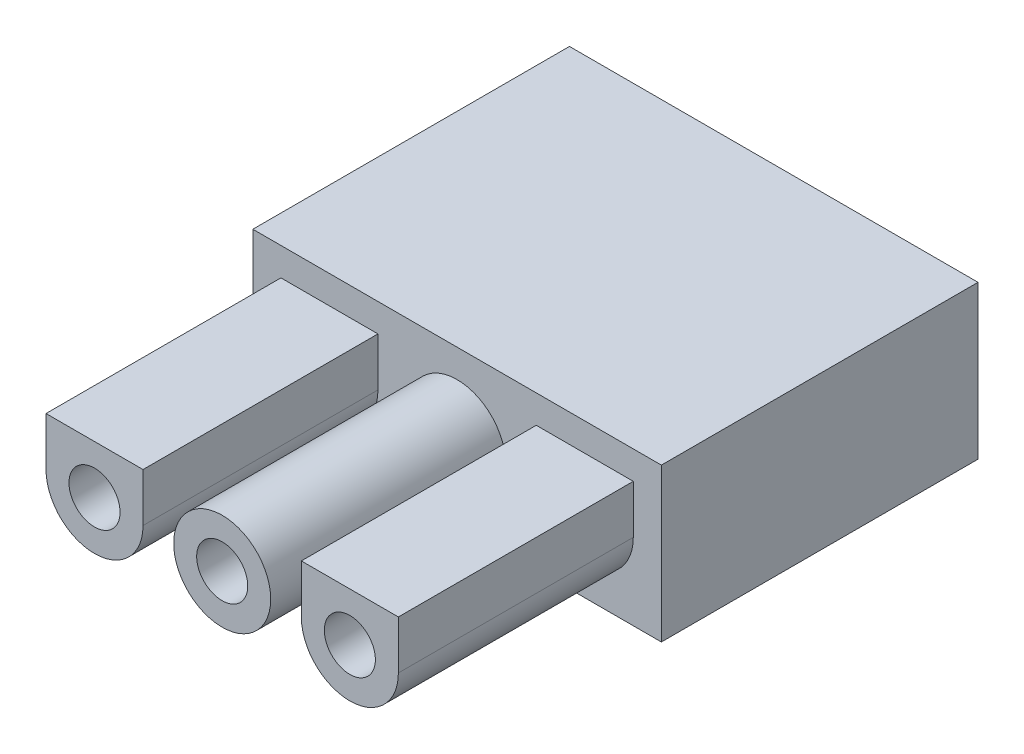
ISO-10303-21;
HEADER;
FILE_DESCRIPTION(('STEP AP214'),'2;1');
FILE_NAME('part.step','',(''),(''),'','','');
FILE_SCHEMA(('AUTOMOTIVE_DESIGN { 1 0 10303 214 1 1 1 1 }'));
ENDSEC;
DATA;
#1=APPLICATION_CONTEXT('core data for automotive mechanical design processes');
#2=APPLICATION_PROTOCOL_DEFINITION('international standard','automotive_design',2000,#1);
#3=PRODUCT_CONTEXT('',#1,'mechanical');
#4=PRODUCT('Part','Part','',(#3));
#5=PRODUCT_RELATED_PRODUCT_CATEGORY('part','',(#4));
#6=PRODUCT_DEFINITION_FORMATION('','',#4);
#7=PRODUCT_DEFINITION_CONTEXT('part definition',#1,'design');
#8=PRODUCT_DEFINITION('design','',#6,#7);
#9=PRODUCT_DEFINITION_SHAPE('','',#8);
#10=(LENGTH_UNIT() NAMED_UNIT(*) SI_UNIT(.MILLI.,.METRE.));
#11=(NAMED_UNIT(*) PLANE_ANGLE_UNIT() SI_UNIT($,.RADIAN.));
#12=(NAMED_UNIT(*) SI_UNIT($,.STERADIAN.) SOLID_ANGLE_UNIT());
#13=UNCERTAINTY_MEASURE_WITH_UNIT(LENGTH_MEASURE(1.E-05),#10,'distance_accuracy_value','');
#14=(GEOMETRIC_REPRESENTATION_CONTEXT(3) GLOBAL_UNCERTAINTY_ASSIGNED_CONTEXT((#13)) GLOBAL_UNIT_ASSIGNED_CONTEXT((#10,
#11,#12)) REPRESENTATION_CONTEXT('',''));
#15=CARTESIAN_POINT('',(0.,0.,0.));
#16=DIRECTION('',(0.,0.,1.));
#17=DIRECTION('',(1.,0.,0.));
#18=AXIS2_PLACEMENT_3D('',#15,#16,#17);
#19=CARTESIAN_POINT('',(0.,-7.62,15.748));
#20=DIRECTION('',(0.,0.,1.));
#21=DIRECTION('',(1.,0.,0.));
#22=AXIS2_PLACEMENT_3D('',#19,#20,#21);
#23=PLANE('',#22);
#24=DIRECTION('',(0.,1.,0.));
#25=VECTOR('',#24,1.);
#26=CARTESIAN_POINT('',(18.923,-3.81,15.748));
#27=LINE('',#26,#25);
#28=CARTESIAN_POINT('',(18.923,-3.81,15.748));
#29=VERTEX_POINT('',#28);
#30=CARTESIAN_POINT('',(18.923,-1.39700000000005,15.748));
#31=VERTEX_POINT('',#30);
#32=EDGE_CURVE('E128',#29,#31,#27,.T.);
#33=ORIENTED_EDGE('',*,*,#32,.F.);
#34=CARTESIAN_POINT('',(16.51,-3.81,15.748));
#35=DIRECTION('',(0.,0.,1.));
#36=DIRECTION('',(1.,0.,0.));
#37=AXIS2_PLACEMENT_3D('',#34,#35,#36);
#38=CIRCLE('',#37,2.413);
#39=CARTESIAN_POINT('',(14.097,-3.81,15.748));
#40=VERTEX_POINT('',#39);
#41=EDGE_CURVE('E139',#40,#29,#38,.T.);
#42=ORIENTED_EDGE('',*,*,#41,.F.);
#43=DIRECTION('',(0.,-1.,0.));
#44=VECTOR('',#43,1.);
#45=CARTESIAN_POINT('',(14.097,-3.81,15.748));
#46=LINE('',#45,#44);
#47=CARTESIAN_POINT('',(14.0970000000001,-1.39700000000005,15.748));
#48=VERTEX_POINT('',#47);
#49=EDGE_CURVE('E151',#48,#40,#46,.T.);
#50=ORIENTED_EDGE('',*,*,#49,.F.);
#51=DIRECTION('',(-1.,0.,0.));
#52=VECTOR('',#51,1.);
#53=CARTESIAN_POINT('',(16.51,-1.397,15.748));
#54=LINE('',#53,#52);
#55=EDGE_CURVE('E149',#31,#48,#54,.T.);
#56=ORIENTED_EDGE('',*,*,#55,.F.);
#57=EDGE_LOOP('',(#33,#42,#50,#56));
#58=FACE_BOUND('',#57,.T.);
#59=DIRECTION('',(0.,-1.,0.));
#60=VECTOR('',#59,1.);
#61=CARTESIAN_POINT('',(0.,0.,15.748));
#62=LINE('',#61,#60);
#63=CARTESIAN_POINT('',(0.,0.,15.748));
#64=VERTEX_POINT('',#63);
#65=CARTESIAN_POINT('',(0.,-7.62,15.748));
#66=VERTEX_POINT('',#65);
#67=EDGE_CURVE('E201',#64,#66,#62,.T.);
#68=ORIENTED_EDGE('',*,*,#67,.T.);
#69=DIRECTION('',(1.,0.,0.));
#70=VECTOR('',#69,1.);
#71=CARTESIAN_POINT('',(0.,-7.62,15.748));
#72=LINE('',#71,#70);
#73=CARTESIAN_POINT('',(20.32,-7.62,15.748));
#74=VERTEX_POINT('',#73);
#75=EDGE_CURVE('E204',#66,#74,#72,.T.);
#76=ORIENTED_EDGE('',*,*,#75,.T.);
#77=DIRECTION('',(0.,1.,0.));
#78=VECTOR('',#77,1.);
#79=CARTESIAN_POINT('',(20.32,0.,15.748));
#80=LINE('',#79,#78);
#81=CARTESIAN_POINT('',(20.32,0.,15.748));
#82=VERTEX_POINT('',#81);
#83=EDGE_CURVE('E206',#74,#82,#80,.T.);
#84=ORIENTED_EDGE('',*,*,#83,.T.);
#85=DIRECTION('',(-1.,0.,0.));
#86=VECTOR('',#85,1.);
#87=CARTESIAN_POINT('',(0.,0.,15.748));
#88=LINE('',#87,#86);
#89=EDGE_CURVE('E208',#82,#64,#88,.T.);
#90=ORIENTED_EDGE('',*,*,#89,.T.);
#91=EDGE_LOOP('',(#68,#76,#84,#90));
#92=FACE_BOUND('',#91,.T.);
#93=DIRECTION('',(0.,1.,0.));
#94=VECTOR('',#93,1.);
#95=CARTESIAN_POINT('',(6.22300000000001,-3.81000000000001,15.748));
#96=LINE('',#95,#94);
#97=CARTESIAN_POINT('',(6.22300000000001,-3.81000000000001,15.748));
#98=VERTEX_POINT('',#97);
#99=CARTESIAN_POINT('',(6.22299999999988,-1.39700000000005,15.748));
#100=VERTEX_POINT('',#99);
#101=EDGE_CURVE('E168',#98,#100,#96,.T.);
#102=ORIENTED_EDGE('',*,*,#101,.F.);
#103=CARTESIAN_POINT('',(3.81,-3.81000000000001,15.748));
#104=DIRECTION('',(0.,0.,1.));
#105=DIRECTION('',(-1.,0.,0.));
#106=AXIS2_PLACEMENT_3D('',#103,#104,#105);
#107=CIRCLE('',#106,2.413);
#108=CARTESIAN_POINT('',(1.397,-3.81000000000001,15.748));
#109=VERTEX_POINT('',#108);
#110=EDGE_CURVE('E134',#109,#98,#107,.T.);
#111=ORIENTED_EDGE('',*,*,#110,.F.);
#112=DIRECTION('',(0.,-1.,0.));
#113=VECTOR('',#112,1.);
#114=CARTESIAN_POINT('',(1.397,-3.81000000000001,15.748));
#115=LINE('',#114,#113);
#116=CARTESIAN_POINT('',(1.39699999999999,-1.39700000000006,15.748));
#117=VERTEX_POINT('',#116);
#118=EDGE_CURVE('E172',#117,#109,#115,.T.);
#119=ORIENTED_EDGE('',*,*,#118,.F.);
#120=DIRECTION('',(-1.,0.,0.));
#121=VECTOR('',#120,1.);
#122=CARTESIAN_POINT('',(3.81,-1.39700000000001,15.748));
#123=LINE('',#122,#121);
#124=EDGE_CURVE('E170',#100,#117,#123,.T.);
#125=ORIENTED_EDGE('',*,*,#124,.F.);
#126=EDGE_LOOP('',(#102,#111,#119,#125));
#127=FACE_BOUND('',#126,.T.);
#128=CARTESIAN_POINT('',(10.16,-3.81,15.748));
#129=DIRECTION('',(0.,0.,1.));
#130=DIRECTION('',(1.,0.,0.));
#131=AXIS2_PLACEMENT_3D('',#128,#129,#130);
#132=CIRCLE('',#131,2.413);
#133=CARTESIAN_POINT('',(12.573,-3.81,15.748));
#134=VERTEX_POINT('',#133);
#135=EDGE_CURVE('E276',#134,#134,#132,.T.);
#136=ORIENTED_EDGE('',*,*,#135,.F.);
#137=EDGE_LOOP('',(#136));
#138=FACE_BOUND('',#137,.T.);
#139=ADVANCED_FACE('F33',(#58,#92,#127,#138),#23,.T.);
#140=CARTESIAN_POINT('',(0.,0.,15.748));
#141=DIRECTION('',(1.,0.,0.));
#142=DIRECTION('',(0.,1.,0.));
#143=AXIS2_PLACEMENT_3D('',#140,#141,#142);
#144=PLANE('',#143);
#145=DIRECTION('',(0.,-1.,0.));
#146=VECTOR('',#145,1.);
#147=CARTESIAN_POINT('',(0.,0.,0.));
#148=LINE('',#147,#146);
#149=CARTESIAN_POINT('',(0.,0.,0.));
#150=VERTEX_POINT('',#149);
#151=CARTESIAN_POINT('',(0.,-7.62,0.));
#152=VERTEX_POINT('',#151);
#153=EDGE_CURVE('E192',#150,#152,#148,.T.);
#154=ORIENTED_EDGE('',*,*,#153,.T.);
#155=DIRECTION('',(0.,0.,-1.));
#156=VECTOR('',#155,1.);
#157=CARTESIAN_POINT('',(0.,-7.62,15.748));
#158=LINE('',#157,#156);
#159=EDGE_CURVE('E11',#66,#152,#158,.T.);
#160=ORIENTED_EDGE('',*,*,#159,.F.);
#161=ORIENTED_EDGE('',*,*,#67,.F.);
#162=DIRECTION('',(0.,0.,-1.));
#163=VECTOR('',#162,1.);
#164=CARTESIAN_POINT('',(0.,0.,15.748));
#165=LINE('',#164,#163);
#166=EDGE_CURVE('E210',#64,#150,#165,.T.);
#167=ORIENTED_EDGE('',*,*,#166,.T.);
#168=EDGE_LOOP('',(#154,#160,#161,#167));
#169=FACE_BOUND('',#168,.T.);
#170=ADVANCED_FACE('F35',(#169),#144,.F.);
#171=CARTESIAN_POINT('',(0.,-7.62,15.748));
#172=DIRECTION('',(0.,1.,0.));
#173=DIRECTION('',(0.,0.,1.));
#174=AXIS2_PLACEMENT_3D('',#171,#172,#173);
#175=PLANE('',#174);
#176=DIRECTION('',(1.,0.,0.));
#177=VECTOR('',#176,1.);
#178=CARTESIAN_POINT('',(0.,-7.62,0.));
#179=LINE('',#178,#177);
#180=CARTESIAN_POINT('',(20.32,-7.62,0.));
#181=VERTEX_POINT('',#180);
#182=EDGE_CURVE('E195',#152,#181,#179,.T.);
#183=ORIENTED_EDGE('',*,*,#182,.T.);
#184=DIRECTION('',(0.,0.,-1.));
#185=VECTOR('',#184,1.);
#186=CARTESIAN_POINT('',(20.32,-7.62,15.748));
#187=LINE('',#186,#185);
#188=EDGE_CURVE('E41',#74,#181,#187,.T.);
#189=ORIENTED_EDGE('',*,*,#188,.F.);
#190=ORIENTED_EDGE('',*,*,#75,.F.);
#191=ORIENTED_EDGE('',*,*,#159,.T.);
#192=EDGE_LOOP('',(#183,#189,#190,#191));
#193=FACE_BOUND('',#192,.T.);
#194=ADVANCED_FACE('F235',(#193),#175,.F.);
#195=CARTESIAN_POINT('',(20.32,0.,15.748));
#196=DIRECTION('',(-1.,0.,0.));
#197=DIRECTION('',(0.,-1.,0.));
#198=AXIS2_PLACEMENT_3D('',#195,#196,#197);
#199=PLANE('',#198);
#200=DIRECTION('',(0.,1.,0.));
#201=VECTOR('',#200,1.);
#202=CARTESIAN_POINT('',(20.32,0.,0.));
#203=LINE('',#202,#201);
#204=CARTESIAN_POINT('',(20.32,0.,0.));
#205=VERTEX_POINT('',#204);
#206=EDGE_CURVE('E197',#181,#205,#203,.T.);
#207=ORIENTED_EDGE('',*,*,#206,.T.);
#208=DIRECTION('',(0.,0.,-1.));
#209=VECTOR('',#208,1.);
#210=CARTESIAN_POINT('',(20.32,0.,15.748));
#211=LINE('',#210,#209);
#212=EDGE_CURVE('E213',#82,#205,#211,.T.);
#213=ORIENTED_EDGE('',*,*,#212,.F.);
#214=ORIENTED_EDGE('',*,*,#83,.F.);
#215=ORIENTED_EDGE('',*,*,#188,.T.);
#216=EDGE_LOOP('',(#207,#213,#214,#215));
#217=FACE_BOUND('',#216,.T.);
#218=ADVANCED_FACE('F220',(#217),#199,.F.);
#219=CARTESIAN_POINT('',(0.,0.,15.748));
#220=DIRECTION('',(0.,-1.,0.));
#221=DIRECTION('',(0.,0.,-1.));
#222=AXIS2_PLACEMENT_3D('',#219,#220,#221);
#223=PLANE('',#222);
#224=DIRECTION('',(-1.,0.,0.));
#225=VECTOR('',#224,1.);
#226=CARTESIAN_POINT('',(0.,0.,0.));
#227=LINE('',#226,#225);
#228=EDGE_CURVE('E199',#205,#150,#227,.T.);
#229=ORIENTED_EDGE('',*,*,#228,.T.);
#230=ORIENTED_EDGE('',*,*,#166,.F.);
#231=ORIENTED_EDGE('',*,*,#89,.F.);
#232=ORIENTED_EDGE('',*,*,#212,.T.);
#233=EDGE_LOOP('',(#229,#230,#231,#232));
#234=FACE_BOUND('',#233,.T.);
#235=ADVANCED_FACE('F229',(#234),#223,.F.);
#236=CARTESIAN_POINT('',(0.,-7.62,0.));
#237=DIRECTION('',(0.,0.,1.));
#238=DIRECTION('',(1.,0.,0.));
#239=AXIS2_PLACEMENT_3D('',#236,#237,#238);
#240=PLANE('',#239);
#241=CARTESIAN_POINT('',(10.16,-3.81,0.));
#242=DIRECTION('',(0.,0.,-1.));
#243=DIRECTION('',(-1.,0.,0.));
#244=AXIS2_PLACEMENT_3D('',#241,#242,#243);
#245=CIRCLE('',#244,1.27);
#246=CARTESIAN_POINT('',(8.89000000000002,-3.81,0.));
#247=VERTEX_POINT('',#246);
#248=EDGE_CURVE('E263',#247,#247,#245,.T.);
#249=ORIENTED_EDGE('',*,*,#248,.F.);
#250=EDGE_LOOP('',(#249));
#251=FACE_BOUND('',#250,.T.);
#252=CARTESIAN_POINT('',(16.51,-3.81,0.));
#253=DIRECTION('',(0.,0.,-1.));
#254=DIRECTION('',(-1.,0.,0.));
#255=AXIS2_PLACEMENT_3D('',#252,#253,#254);
#256=CIRCLE('',#255,1.27);
#257=CARTESIAN_POINT('',(15.24,-3.81,0.));
#258=VERTEX_POINT('',#257);
#259=EDGE_CURVE('E267',#258,#258,#256,.T.);
#260=ORIENTED_EDGE('',*,*,#259,.F.);
#261=EDGE_LOOP('',(#260));
#262=FACE_BOUND('',#261,.T.);
#263=CARTESIAN_POINT('',(3.81,-3.81000000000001,0.));
#264=DIRECTION('',(0.,0.,-1.));
#265=DIRECTION('',(-1.,0.,0.));
#266=AXIS2_PLACEMENT_3D('',#263,#264,#265);
#267=CIRCLE('',#266,1.27);
#268=CARTESIAN_POINT('',(2.54,-3.81000000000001,0.));
#269=VERTEX_POINT('',#268);
#270=EDGE_CURVE('E270',#269,#269,#267,.T.);
#271=ORIENTED_EDGE('',*,*,#270,.F.);
#272=EDGE_LOOP('',(#271));
#273=FACE_BOUND('',#272,.T.);
#274=ORIENTED_EDGE('',*,*,#153,.F.);
#275=ORIENTED_EDGE('',*,*,#228,.F.);
#276=ORIENTED_EDGE('',*,*,#206,.F.);
#277=ORIENTED_EDGE('',*,*,#182,.F.);
#278=EDGE_LOOP('',(#274,#275,#276,#277));
#279=FACE_BOUND('',#278,.T.);
#280=ADVANCED_FACE('F226',(#251,#262,#273,#279),#240,.F.);
#281=CARTESIAN_POINT('',(3.81,-3.81000000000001,27.432));
#282=DIRECTION('',(0.,0.,-1.));
#283=DIRECTION('',(-1.,0.,0.));
#284=AXIS2_PLACEMENT_3D('',#281,#282,#283);
#285=CYLINDRICAL_SURFACE('',#284,2.413);
#286=ORIENTED_EDGE('',*,*,#110,.T.);
#287=DIRECTION('',(0.,0.,-1.));
#288=VECTOR('',#287,1.);
#289=CARTESIAN_POINT('',(6.22300000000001,-3.81000000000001,27.432));
#290=LINE('',#289,#288);
#291=CARTESIAN_POINT('',(6.22300000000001,-3.81000000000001,27.432));
#292=VERTEX_POINT('',#291);
#293=EDGE_CURVE('E190',#292,#98,#290,.T.);
#294=ORIENTED_EDGE('',*,*,#293,.F.);
#295=CARTESIAN_POINT('',(3.81,-3.81000000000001,27.432));
#296=DIRECTION('',(0.,0.,1.));
#297=DIRECTION('',(-1.,0.,0.));
#298=AXIS2_PLACEMENT_3D('',#295,#296,#297);
#299=CIRCLE('',#298,2.413);
#300=CARTESIAN_POINT('',(1.397,-3.81000000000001,27.432));
#301=VERTEX_POINT('',#300);
#302=EDGE_CURVE('E174',#301,#292,#299,.T.);
#303=ORIENTED_EDGE('',*,*,#302,.F.);
#304=DIRECTION('',(0.,0.,-1.));
#305=VECTOR('',#304,1.);
#306=CARTESIAN_POINT('',(1.397,-3.81000000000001,27.432));
#307=LINE('',#306,#305);
#308=EDGE_CURVE('E183',#301,#109,#307,.T.);
#309=ORIENTED_EDGE('',*,*,#308,.T.);
#310=EDGE_LOOP('',(#286,#294,#303,#309));
#311=FACE_BOUND('',#310,.T.);
#312=ADVANCED_FACE('F253',(#311),#285,.T.);
#313=CARTESIAN_POINT('',(6.22300000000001,-3.81000000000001,27.432));
#314=DIRECTION('',(-1.,0.,0.));
#315=DIRECTION('',(0.,-1.,0.));
#316=AXIS2_PLACEMENT_3D('',#313,#314,#315);
#317=PLANE('',#316);
#318=ORIENTED_EDGE('',*,*,#101,.T.);
#319=DIRECTION('',(0.,0.,-1.));
#320=VECTOR('',#319,1.);
#321=CARTESIAN_POINT('',(6.22299999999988,-1.39700000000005,27.432));
#322=LINE('',#321,#320);
#323=CARTESIAN_POINT('',(6.22299999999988,-1.39700000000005,27.432));
#324=VERTEX_POINT('',#323);
#325=EDGE_CURVE('E187',#324,#100,#322,.T.);
#326=ORIENTED_EDGE('',*,*,#325,.F.);
#327=DIRECTION('',(0.,1.,0.));
#328=VECTOR('',#327,1.);
#329=CARTESIAN_POINT('',(6.22300000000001,-3.81000000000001,27.432));
#330=LINE('',#329,#328);
#331=EDGE_CURVE('E177',#292,#324,#330,.T.);
#332=ORIENTED_EDGE('',*,*,#331,.F.);
#333=ORIENTED_EDGE('',*,*,#293,.T.);
#334=EDGE_LOOP('',(#318,#326,#332,#333));
#335=FACE_BOUND('',#334,.T.);
#336=ADVANCED_FACE('F258',(#335),#317,.F.);
#337=CARTESIAN_POINT('',(3.81,-1.39700000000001,27.432));
#338=DIRECTION('',(0.,-1.,0.));
#339=DIRECTION('',(1.,0.,0.));
#340=AXIS2_PLACEMENT_3D('',#337,#338,#339);
#341=PLANE('',#340);
#342=ORIENTED_EDGE('',*,*,#124,.T.);
#343=DIRECTION('',(0.,0.,-1.));
#344=VECTOR('',#343,1.);
#345=CARTESIAN_POINT('',(1.39699999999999,-1.39700000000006,27.432));
#346=LINE('',#345,#344);
#347=CARTESIAN_POINT('',(1.39699999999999,-1.39700000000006,27.432));
#348=VERTEX_POINT('',#347);
#349=EDGE_CURVE('E56',#348,#117,#346,.T.);
#350=ORIENTED_EDGE('',*,*,#349,.F.);
#351=DIRECTION('',(-1.,0.,0.));
#352=VECTOR('',#351,1.);
#353=CARTESIAN_POINT('',(3.81,-1.39700000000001,27.432));
#354=LINE('',#353,#352);
#355=EDGE_CURVE('E179',#324,#348,#354,.T.);
#356=ORIENTED_EDGE('',*,*,#355,.F.);
#357=ORIENTED_EDGE('',*,*,#325,.T.);
#358=EDGE_LOOP('',(#342,#350,#356,#357));
#359=FACE_BOUND('',#358,.T.);
#360=ADVANCED_FACE('F324',(#359),#341,.F.);
#361=CARTESIAN_POINT('',(1.397,-3.81000000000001,27.432));
#362=DIRECTION('',(1.,0.,0.));
#363=DIRECTION('',(0.,1.,0.));
#364=AXIS2_PLACEMENT_3D('',#361,#362,#363);
#365=PLANE('',#364);
#366=ORIENTED_EDGE('',*,*,#118,.T.);
#367=ORIENTED_EDGE('',*,*,#308,.F.);
#368=DIRECTION('',(0.,-1.,0.));
#369=VECTOR('',#368,1.);
#370=CARTESIAN_POINT('',(1.397,-3.81000000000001,27.432));
#371=LINE('',#370,#369);
#372=EDGE_CURVE('E181',#348,#301,#371,.T.);
#373=ORIENTED_EDGE('',*,*,#372,.F.);
#374=ORIENTED_EDGE('',*,*,#349,.T.);
#375=EDGE_LOOP('',(#366,#367,#373,#374));
#376=FACE_BOUND('',#375,.T.);
#377=ADVANCED_FACE('F320',(#376),#365,.F.);
#378=CARTESIAN_POINT('',(3.81,-3.81000000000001,27.432));
#379=DIRECTION('',(0.,0.,-1.));
#380=DIRECTION('',(-1.,0.,0.));
#381=AXIS2_PLACEMENT_3D('',#378,#379,#380);
#382=PLANE('',#381);
#383=CARTESIAN_POINT('',(3.81,-3.81000000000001,27.432));
#384=DIRECTION('',(0.,0.,-1.));
#385=DIRECTION('',(-1.,0.,0.));
#386=AXIS2_PLACEMENT_3D('',#383,#384,#385);
#387=CIRCLE('',#386,1.27);
#388=CARTESIAN_POINT('',(2.54,-3.81000000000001,27.432));
#389=VERTEX_POINT('',#388);
#390=EDGE_CURVE('E272',#389,#389,#387,.T.);
#391=ORIENTED_EDGE('',*,*,#390,.T.);
#392=EDGE_LOOP('',(#391));
#393=FACE_BOUND('',#392,.T.);
#394=ORIENTED_EDGE('',*,*,#302,.T.);
#395=ORIENTED_EDGE('',*,*,#331,.T.);
#396=ORIENTED_EDGE('',*,*,#355,.T.);
#397=ORIENTED_EDGE('',*,*,#372,.T.);
#398=EDGE_LOOP('',(#394,#395,#396,#397));
#399=FACE_BOUND('',#398,.T.);
#400=ADVANCED_FACE('F317',(#393,#399),#382,.F.);
#401=CARTESIAN_POINT('',(16.51,-3.81,27.432));
#402=DIRECTION('',(0.,0.,-1.));
#403=DIRECTION('',(-1.,0.,0.));
#404=AXIS2_PLACEMENT_3D('',#401,#402,#403);
#405=CYLINDRICAL_SURFACE('',#404,2.413);
#406=ORIENTED_EDGE('',*,*,#41,.T.);
#407=DIRECTION('',(0.,0.,-1.));
#408=VECTOR('',#407,1.);
#409=CARTESIAN_POINT('',(18.923,-3.81,27.432));
#410=LINE('',#409,#408);
#411=CARTESIAN_POINT('',(18.923,-3.81,27.432));
#412=VERTEX_POINT('',#411);
#413=EDGE_CURVE('E123',#412,#29,#410,.T.);
#414=ORIENTED_EDGE('',*,*,#413,.F.);
#415=CARTESIAN_POINT('',(16.51,-3.81,27.432));
#416=DIRECTION('',(0.,0.,1.));
#417=DIRECTION('',(1.,0.,0.));
#418=AXIS2_PLACEMENT_3D('',#415,#416,#417);
#419=CIRCLE('',#418,2.413);
#420=CARTESIAN_POINT('',(14.097,-3.81,27.432));
#421=VERTEX_POINT('',#420);
#422=EDGE_CURVE('E156',#421,#412,#419,.T.);
#423=ORIENTED_EDGE('',*,*,#422,.F.);
#424=DIRECTION('',(0.,0.,-1.));
#425=VECTOR('',#424,1.);
#426=CARTESIAN_POINT('',(14.097,-3.81,27.432));
#427=LINE('',#426,#425);
#428=EDGE_CURVE('E142',#421,#40,#427,.T.);
#429=ORIENTED_EDGE('',*,*,#428,.T.);
#430=EDGE_LOOP('',(#406,#414,#423,#429));
#431=FACE_BOUND('',#430,.T.);
#432=ADVANCED_FACE('F140',(#431),#405,.T.);
#433=CARTESIAN_POINT('',(18.923,-3.81,27.432));
#434=DIRECTION('',(-1.,0.,0.));
#435=DIRECTION('',(0.,-1.,0.));
#436=AXIS2_PLACEMENT_3D('',#433,#434,#435);
#437=PLANE('',#436);
#438=ORIENTED_EDGE('',*,*,#32,.T.);
#439=DIRECTION('',(0.,0.,-1.));
#440=VECTOR('',#439,1.);
#441=CARTESIAN_POINT('',(18.923,-1.39700000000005,27.432));
#442=LINE('',#441,#440);
#443=CARTESIAN_POINT('',(18.923,-1.39700000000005,27.432));
#444=VERTEX_POINT('',#443);
#445=EDGE_CURVE('E135',#444,#31,#442,.T.);
#446=ORIENTED_EDGE('',*,*,#445,.F.);
#447=DIRECTION('',(0.,1.,0.));
#448=VECTOR('',#447,1.);
#449=CARTESIAN_POINT('',(18.923,-3.81,27.432));
#450=LINE('',#449,#448);
#451=EDGE_CURVE('E130',#412,#444,#450,.T.);
#452=ORIENTED_EDGE('',*,*,#451,.F.);
#453=ORIENTED_EDGE('',*,*,#413,.T.);
#454=EDGE_LOOP('',(#438,#446,#452,#453));
#455=FACE_BOUND('',#454,.T.);
#456=ADVANCED_FACE('F125',(#455),#437,.F.);
#457=CARTESIAN_POINT('',(16.51,-1.397,27.432));
#458=DIRECTION('',(0.,-1.,0.));
#459=DIRECTION('',(1.,0.,0.));
#460=AXIS2_PLACEMENT_3D('',#457,#458,#459);
#461=PLANE('',#460);
#462=ORIENTED_EDGE('',*,*,#55,.T.);
#463=DIRECTION('',(0.,0.,-1.));
#464=VECTOR('',#463,1.);
#465=CARTESIAN_POINT('',(14.0970000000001,-1.39700000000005,27.432));
#466=LINE('',#465,#464);
#467=CARTESIAN_POINT('',(14.0970000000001,-1.39700000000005,27.432));
#468=VERTEX_POINT('',#467);
#469=EDGE_CURVE('E48',#468,#48,#466,.T.);
#470=ORIENTED_EDGE('',*,*,#469,.F.);
#471=DIRECTION('',(-1.,0.,0.));
#472=VECTOR('',#471,1.);
#473=CARTESIAN_POINT('',(16.51,-1.397,27.432));
#474=LINE('',#473,#472);
#475=EDGE_CURVE('E159',#444,#468,#474,.T.);
#476=ORIENTED_EDGE('',*,*,#475,.F.);
#477=ORIENTED_EDGE('',*,*,#445,.T.);
#478=EDGE_LOOP('',(#462,#470,#476,#477));
#479=FACE_BOUND('',#478,.T.);
#480=ADVANCED_FACE('F309',(#479),#461,.F.);
#481=CARTESIAN_POINT('',(14.097,-3.81,27.432));
#482=DIRECTION('',(1.,0.,0.));
#483=DIRECTION('',(0.,1.,0.));
#484=AXIS2_PLACEMENT_3D('',#481,#482,#483);
#485=PLANE('',#484);
#486=ORIENTED_EDGE('',*,*,#49,.T.);
#487=ORIENTED_EDGE('',*,*,#428,.F.);
#488=DIRECTION('',(0.,-1.,0.));
#489=VECTOR('',#488,1.);
#490=CARTESIAN_POINT('',(14.097,-3.81,27.432));
#491=LINE('',#490,#489);
#492=EDGE_CURVE('E161',#468,#421,#491,.T.);
#493=ORIENTED_EDGE('',*,*,#492,.F.);
#494=ORIENTED_EDGE('',*,*,#469,.T.);
#495=EDGE_LOOP('',(#486,#487,#493,#494));
#496=FACE_BOUND('',#495,.T.);
#497=ADVANCED_FACE('F302',(#496),#485,.F.);
#498=CARTESIAN_POINT('',(16.51,-3.81,27.432));
#499=DIRECTION('',(0.,0.,1.));
#500=DIRECTION('',(1.,0.,0.));
#501=AXIS2_PLACEMENT_3D('',#498,#499,#500);
#502=PLANE('',#501);
#503=CARTESIAN_POINT('',(16.51,-3.81,27.432));
#504=DIRECTION('',(0.,0.,-1.));
#505=DIRECTION('',(-1.,0.,0.));
#506=AXIS2_PLACEMENT_3D('',#503,#504,#505);
#507=CIRCLE('',#506,1.27);
#508=CARTESIAN_POINT('',(15.24,-3.81,27.432));
#509=VERTEX_POINT('',#508);
#510=EDGE_CURVE('E273',#509,#509,#507,.T.);
#511=ORIENTED_EDGE('',*,*,#510,.T.);
#512=EDGE_LOOP('',(#511));
#513=FACE_BOUND('',#512,.T.);
#514=ORIENTED_EDGE('',*,*,#422,.T.);
#515=ORIENTED_EDGE('',*,*,#451,.T.);
#516=ORIENTED_EDGE('',*,*,#475,.T.);
#517=ORIENTED_EDGE('',*,*,#492,.T.);
#518=EDGE_LOOP('',(#514,#515,#516,#517));
#519=FACE_BOUND('',#518,.T.);
#520=ADVANCED_FACE('F291',(#513,#519),#502,.T.);
#521=CARTESIAN_POINT('',(10.16,-3.81,27.432));
#522=DIRECTION('',(0.,0.,-1.));
#523=DIRECTION('',(-1.,0.,0.));
#524=AXIS2_PLACEMENT_3D('',#521,#522,#523);
#525=CYLINDRICAL_SURFACE('',#524,2.413);
#526=CARTESIAN_POINT('',(10.16,-3.81,27.432));
#527=DIRECTION('',(0.,0.,1.));
#528=DIRECTION('',(1.,0.,0.));
#529=AXIS2_PLACEMENT_3D('',#526,#527,#528);
#530=CIRCLE('',#529,2.413);
#531=CARTESIAN_POINT('',(12.573,-3.81,27.432));
#532=VERTEX_POINT('',#531);
#533=EDGE_CURVE('E145',#532,#532,#530,.T.);
#534=ORIENTED_EDGE('',*,*,#533,.F.);
#535=EDGE_LOOP('',(#534));
#536=FACE_BOUND('',#535,.T.);
#537=ORIENTED_EDGE('',*,*,#135,.T.);
#538=EDGE_LOOP('',(#537));
#539=FACE_BOUND('',#538,.T.);
#540=ADVANCED_FACE('F288',(#536,#539),#525,.T.);
#541=CARTESIAN_POINT('',(10.16,-3.81,27.432));
#542=DIRECTION('',(0.,0.,1.));
#543=DIRECTION('',(1.,0.,0.));
#544=AXIS2_PLACEMENT_3D('',#541,#542,#543);
#545=PLANE('',#544);
#546=CARTESIAN_POINT('',(10.16,-3.81,27.432));
#547=DIRECTION('',(0.,0.,-1.));
#548=DIRECTION('',(-1.,0.,0.));
#549=AXIS2_PLACEMENT_3D('',#546,#547,#548);
#550=CIRCLE('',#549,1.27);
#551=CARTESIAN_POINT('',(8.89000000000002,-3.81,27.432));
#552=VERTEX_POINT('',#551);
#553=EDGE_CURVE('E421',#552,#552,#550,.T.);
#554=ORIENTED_EDGE('',*,*,#553,.T.);
#555=EDGE_LOOP('',(#554));
#556=FACE_BOUND('',#555,.T.);
#557=ORIENTED_EDGE('',*,*,#533,.T.);
#558=EDGE_LOOP('',(#557));
#559=FACE_BOUND('',#558,.T.);
#560=ADVANCED_FACE('F286',(#556,#559),#545,.T.);
#561=CARTESIAN_POINT('',(3.81,-3.81000000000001,27.432));
#562=DIRECTION('',(0.,0.,-1.));
#563=DIRECTION('',(-1.,0.,0.));
#564=AXIS2_PLACEMENT_3D('',#561,#562,#563);
#565=CYLINDRICAL_SURFACE('',#564,1.27);
#566=ORIENTED_EDGE('',*,*,#390,.F.);
#567=EDGE_LOOP('',(#566));
#568=FACE_BOUND('',#567,.T.);
#569=ORIENTED_EDGE('',*,*,#270,.T.);
#570=EDGE_LOOP('',(#569));
#571=FACE_BOUND('',#570,.T.);
#572=ADVANCED_FACE('F299',(#568,#571),#565,.F.);
#573=CARTESIAN_POINT('',(16.51,-3.81,27.432));
#574=DIRECTION('',(0.,0.,-1.));
#575=DIRECTION('',(-1.,0.,0.));
#576=AXIS2_PLACEMENT_3D('',#573,#574,#575);
#577=CYLINDRICAL_SURFACE('',#576,1.27);
#578=ORIENTED_EDGE('',*,*,#510,.F.);
#579=EDGE_LOOP('',(#578));
#580=FACE_BOUND('',#579,.T.);
#581=ORIENTED_EDGE('',*,*,#259,.T.);
#582=EDGE_LOOP('',(#581));
#583=FACE_BOUND('',#582,.T.);
#584=ADVANCED_FACE('F395',(#580,#583),#577,.F.);
#585=CARTESIAN_POINT('',(10.16,-3.81,27.432));
#586=DIRECTION('',(0.,0.,-1.));
#587=DIRECTION('',(-1.,0.,0.));
#588=AXIS2_PLACEMENT_3D('',#585,#586,#587);
#589=CYLINDRICAL_SURFACE('',#588,1.27);
#590=ORIENTED_EDGE('',*,*,#553,.F.);
#591=EDGE_LOOP('',(#590));
#592=FACE_BOUND('',#591,.T.);
#593=ORIENTED_EDGE('',*,*,#248,.T.);
#594=EDGE_LOOP('',(#593));
#595=FACE_BOUND('',#594,.T.);
#596=ADVANCED_FACE('F404',(#592,#595),#589,.F.);
#597=CLOSED_SHELL('',(#139,#170,#194,#218,#235,#280,#312,#336,#360,#377,#400,#432,#456,#480,
#497,#520,#540,#560,#572,#584,#596));
#598=MANIFOLD_SOLID_BREP('B2',#597);
#599=ADVANCED_BREP_SHAPE_REPRESENTATION('',(#18,#598),#14);
#600=SHAPE_DEFINITION_REPRESENTATION(#9,#599);
ENDSEC;
END-ISO-10303-21;
